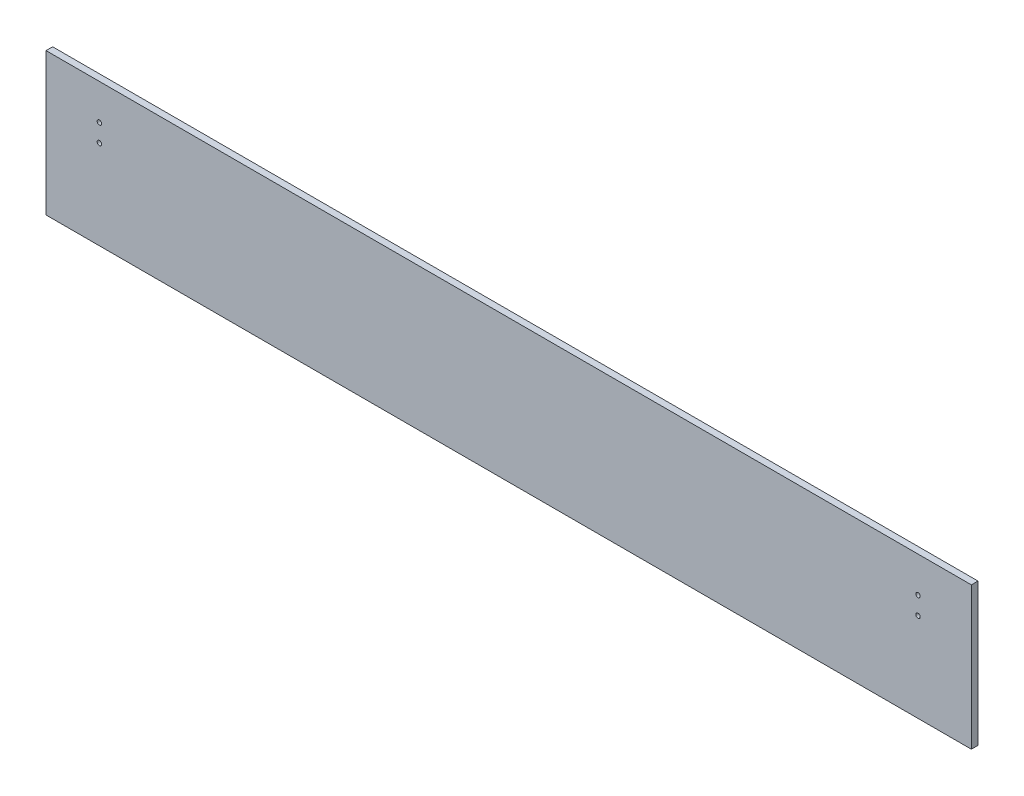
from build123d import *

# Parameters (mm, degrees)
SKETCH1_W                      = 330.2
SKETCH1_H                      = 50.8
BOSS_EXTRUDE1_DEPTH            = 2.3622
F_1_16_0_0625_DIAMETER_HOLE1_D = 1.5875


with BuildPart() as part:
    # Sketch1 → Boss-Extrude1 (new body)
    with BuildSketch(Plane.XY):
        with Locations((165.1, -25.4)):
            Rectangle(SKETCH1_W, SKETCH1_H)
    extrude(amount=BOSS_EXTRUDE1_DEPTH)

    # 1_16 _0.0625_ Diameter Hole1 (through all)
    with Locations(Plane.XY.offset(2.3622)):
        with Locations((19.05, -12.7), (19.05, -19.05), (311.15, -12.7), (311.15, -19.05)):
            Hole(F_1_16_0_0625_DIAMETER_HOLE1_D / 2)


solid = part.part
